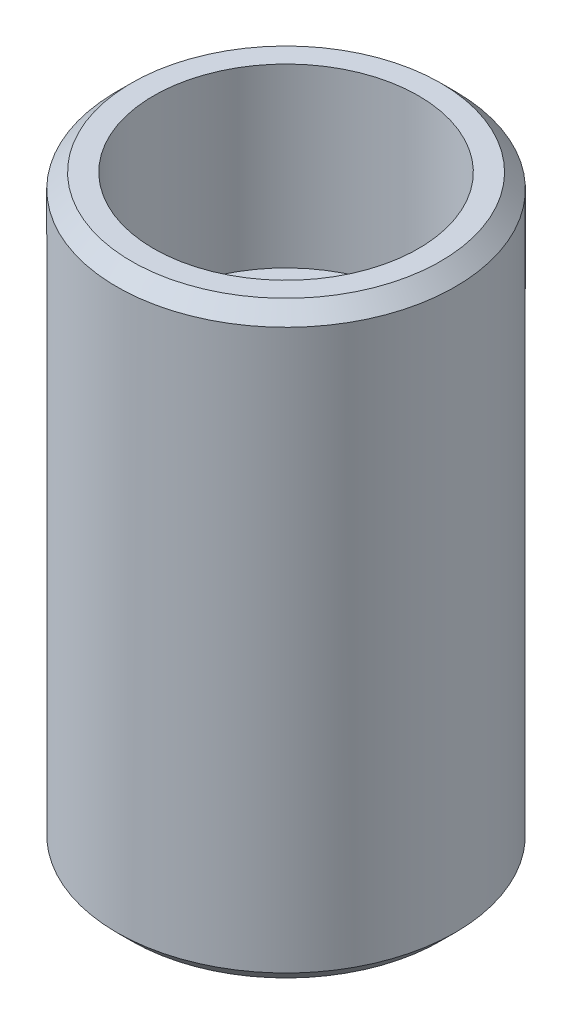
from build123d import *

# Parameters (mm, degrees)
CHANFREIN1_SIZE = 0.5


with BuildPart() as part:
    # Esquisse1 → R_volution1 (revolve)
    with BuildSketch(Plane.XY, mode=Mode.PRIVATE) as r_volution1_sk:
        Polygon((-5.75, 20), (-4.5, 20), (-4.5, 14), (-2.75, 14), (-2.75, 0), (-5.75, 0), align=None)
    revolve(r_volution1_sk.sketch.rotate(Axis((0, 0, 0), (0, 1, 0)), 270), axis=Axis((0, 0, 0), (0, 1, 0)))

    # Chanfrein1
    chanfrein1_edges = [part.edges().sort_by_distance(p)[0] for p in [
        (0, 20, 5.75),
        (0, 0, 2.75),
        (0, 0, 5.75),
    ]]
    chamfer(chanfrein1_edges, length=CHANFREIN1_SIZE)


solid = part.part
